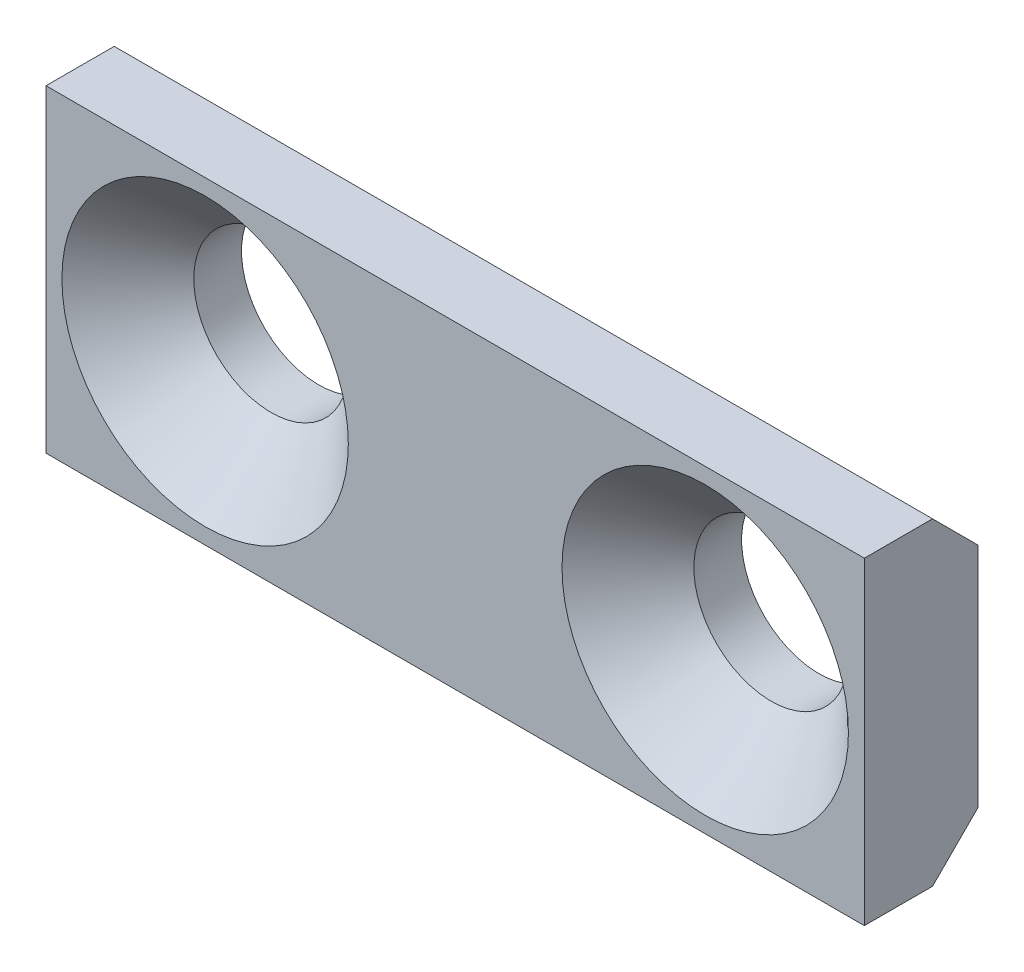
from build123d import *

# Parameters (mm, degrees)
ESQUISSE1_W                              = 18
ESQUISSE1_H                              = 7
EXTRUSION1_DEPTH                         = 2.5
FRAISAGE_POUR_VIS_T_TE_FRAIS_E_F_2_COUNT = 2
FRAISAGE_POUR_VIS_T_TE_FRAIS_E_F_2_PITCH = 11
CHANFREIN1_SIZE                          = 1


with BuildPart() as part:
    # Esquisse1 → Extrusion1 (new body)
    with BuildSketch(Plane.XY):
        Rectangle(ESQUISSE1_W, ESQUISSE1_H)
    extrude(amount=EXTRUSION1_DEPTH)

    # Esquisse2 → Fraisage pour vis _ t_te frais_e _ fond (revolve, cut)
    with BuildSketch(Plane(origin=(-5.5, 0, 2.5), x_dir=(0, -1, 0), z_dir=(1, 0, 0))):
        Polygon((0, 0), (0, 2.5), (1.7, 2.5), (1.7, 1.45), (3.15, 0), align=None)
    fraisage_pour_vis_t_te_frais_e_fond = revolve(axis=Axis((-5.5, 0, 8.85), (0, 0, -1)), mode=Mode.SUBTRACT)

    # Fraisage pour vis _ t_te frais_e _ f 2: Fraisage pour vis _ t_te frais_e _ fond ×2
    with Locations(*[(i * FRAISAGE_POUR_VIS_T_TE_FRAIS_E_F_2_PITCH, 0, 0) for i in range(1, FRAISAGE_POUR_VIS_T_TE_FRAIS_E_F_2_COUNT)]):
        add(fraisage_pour_vis_t_te_frais_e_fond, mode=Mode.SUBTRACT)

    # Chanfrein1
    chanfrein1_edges = [part.edges().sort_by_distance(p)[0] for p in [
        (0, 3.5, 0),
        (0, -3.5, 0),
    ]]
    chamfer(chanfrein1_edges, length=CHANFREIN1_SIZE)


solid = part.part
